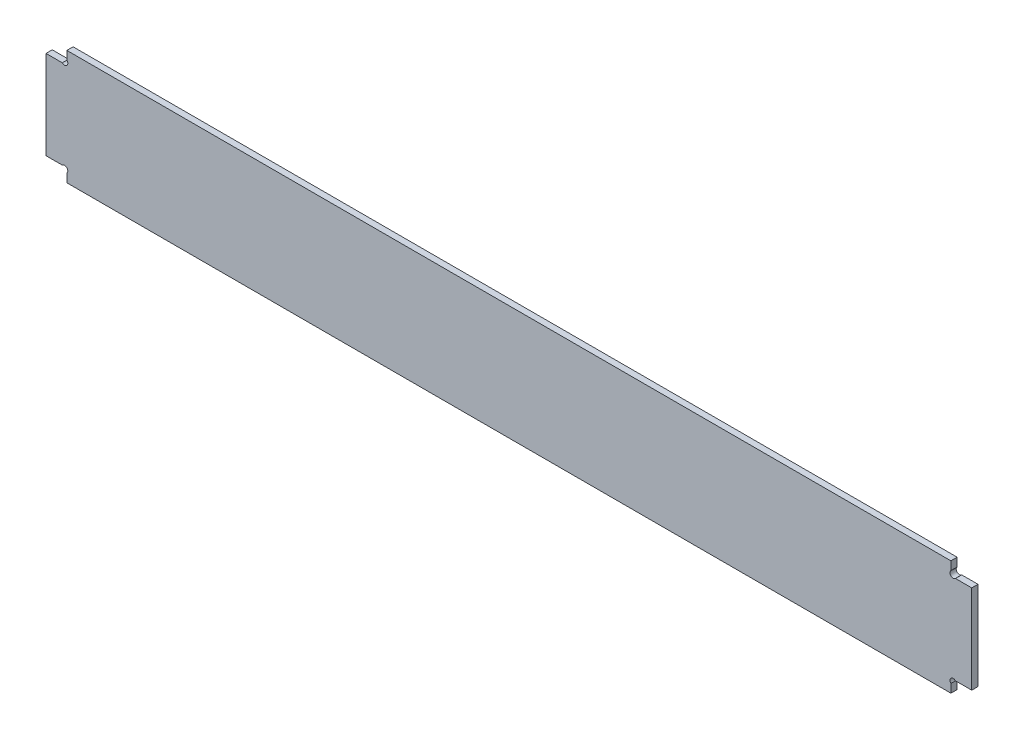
ISO-10303-21;
HEADER;
FILE_DESCRIPTION(('STEP AP214'),'2;1');
FILE_NAME('part.step','',(''),(''),'','','');
FILE_SCHEMA(('AUTOMOTIVE_DESIGN { 1 0 10303 214 1 1 1 1 }'));
ENDSEC;
DATA;
#1=APPLICATION_CONTEXT('core data for automotive mechanical design processes');
#2=APPLICATION_PROTOCOL_DEFINITION('international standard','automotive_design',2000,#1);
#3=PRODUCT_CONTEXT('',#1,'mechanical');
#4=PRODUCT('Part','Part','',(#3));
#5=PRODUCT_RELATED_PRODUCT_CATEGORY('part','',(#4));
#6=PRODUCT_DEFINITION_FORMATION('','',#4);
#7=PRODUCT_DEFINITION_CONTEXT('part definition',#1,'design');
#8=PRODUCT_DEFINITION('design','',#6,#7);
#9=PRODUCT_DEFINITION_SHAPE('','',#8);
#10=(LENGTH_UNIT() NAMED_UNIT(*) SI_UNIT(.MILLI.,.METRE.));
#11=(NAMED_UNIT(*) PLANE_ANGLE_UNIT() SI_UNIT($,.RADIAN.));
#12=(NAMED_UNIT(*) SI_UNIT($,.STERADIAN.) SOLID_ANGLE_UNIT());
#13=UNCERTAINTY_MEASURE_WITH_UNIT(LENGTH_MEASURE(1.E-05),#10,'distance_accuracy_value','');
#14=(GEOMETRIC_REPRESENTATION_CONTEXT(3) GLOBAL_UNCERTAINTY_ASSIGNED_CONTEXT((#13)) GLOBAL_UNIT_ASSIGNED_CONTEXT((#10,
#11,#12)) REPRESENTATION_CONTEXT('',''));
#15=CARTESIAN_POINT('',(0.,0.,0.));
#16=DIRECTION('',(0.,0.,1.));
#17=DIRECTION('',(1.,0.,0.));
#18=AXIS2_PLACEMENT_3D('',#15,#16,#17);
#19=CARTESIAN_POINT('',(8.90398448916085,5.15398448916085,3.));
#20=DIRECTION('',(0.,0.,-1.));
#21=DIRECTION('',(-1.,0.,0.));
#22=AXIS2_PLACEMENT_3D('',#19,#20,#21);
#23=CYLINDRICAL_SURFACE('',#22,1.55);
#24=CARTESIAN_POINT('',(8.90398448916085,5.15398448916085,0.));
#25=DIRECTION('',(0.,0.,-1.));
#26=DIRECTION('',(1.,0.,0.));
#27=AXIS2_PLACEMENT_3D('',#24,#25,#26);
#28=CIRCLE('',#27,1.55);
#29=CARTESIAN_POINT('',(7.8079689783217,6.25,0.));
#30=VERTEX_POINT('',#29);
#31=CARTESIAN_POINT('',(10.,4.0579689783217,0.));
#32=VERTEX_POINT('',#31);
#33=EDGE_CURVE('E142',#30,#32,#28,.T.);
#34=ORIENTED_EDGE('',*,*,#33,.T.);
#35=DIRECTION('',(0.,0.,-1.));
#36=VECTOR('',#35,1.);
#37=CARTESIAN_POINT('',(10.,4.0579689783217,3.));
#38=LINE('',#37,#36);
#39=CARTESIAN_POINT('',(10.,4.0579689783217,3.));
#40=VERTEX_POINT('',#39);
#41=EDGE_CURVE('E11',#40,#32,#38,.T.);
#42=ORIENTED_EDGE('',*,*,#41,.F.);
#43=CARTESIAN_POINT('',(8.90398448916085,5.15398448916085,3.));
#44=DIRECTION('',(0.,0.,-1.));
#45=DIRECTION('',(1.,0.,0.));
#46=AXIS2_PLACEMENT_3D('',#43,#44,#45);
#47=CIRCLE('',#46,1.55);
#48=CARTESIAN_POINT('',(7.8079689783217,6.25,3.));
#49=VERTEX_POINT('',#48);
#50=EDGE_CURVE('E185',#49,#40,#47,.T.);
#51=ORIENTED_EDGE('',*,*,#50,.F.);
#52=DIRECTION('',(0.,0.,-1.));
#53=VECTOR('',#52,1.);
#54=CARTESIAN_POINT('',(7.8079689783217,6.25,3.));
#55=LINE('',#54,#53);
#56=EDGE_CURVE('E155',#49,#30,#55,.T.);
#57=ORIENTED_EDGE('',*,*,#56,.T.);
#58=EDGE_LOOP('',(#34,#42,#51,#57));
#59=FACE_BOUND('',#58,.T.);
#60=ADVANCED_FACE('F26',(#59),#23,.F.);
#61=CARTESIAN_POINT('',(10.,4.0579689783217,3.));
#62=DIRECTION('',(1.,0.,0.));
#63=DIRECTION('',(0.,1.,0.));
#64=AXIS2_PLACEMENT_3D('',#61,#62,#63);
#65=PLANE('',#64);
#66=DIRECTION('',(0.,-1.,0.));
#67=VECTOR('',#66,1.);
#68=CARTESIAN_POINT('',(10.,4.0579689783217,0.));
#69=LINE('',#68,#67);
#70=CARTESIAN_POINT('',(10.,0.,0.));
#71=VERTEX_POINT('',#70);
#72=EDGE_CURVE('E138',#32,#71,#69,.T.);
#73=ORIENTED_EDGE('',*,*,#72,.T.);
#74=DIRECTION('',(0.,0.,-1.));
#75=VECTOR('',#74,1.);
#76=CARTESIAN_POINT('',(10.,0.,3.));
#77=LINE('',#76,#75);
#78=CARTESIAN_POINT('',(10.,0.,3.));
#79=VERTEX_POINT('',#78);
#80=EDGE_CURVE('E33',#79,#71,#77,.T.);
#81=ORIENTED_EDGE('',*,*,#80,.F.);
#82=DIRECTION('',(0.,-1.,0.));
#83=VECTOR('',#82,1.);
#84=CARTESIAN_POINT('',(10.,4.0579689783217,3.));
#85=LINE('',#84,#83);
#86=EDGE_CURVE('E151',#40,#79,#85,.T.);
#87=ORIENTED_EDGE('',*,*,#86,.F.);
#88=ORIENTED_EDGE('',*,*,#41,.T.);
#89=EDGE_LOOP('',(#73,#81,#87,#88));
#90=FACE_BOUND('',#89,.T.);
#91=ADVANCED_FACE('F150',(#90),#65,.F.);
#92=CARTESIAN_POINT('',(434.,0.,3.));
#93=DIRECTION('',(0.,1.,0.));
#94=DIRECTION('',(0.,0.,1.));
#95=AXIS2_PLACEMENT_3D('',#92,#93,#94);
#96=PLANE('',#95);
#97=DIRECTION('',(1.,0.,0.));
#98=VECTOR('',#97,1.);
#99=CARTESIAN_POINT('',(434.,0.,0.));
#100=LINE('',#99,#98);
#101=CARTESIAN_POINT('',(434.,0.,0.));
#102=VERTEX_POINT('',#101);
#103=EDGE_CURVE('E144',#71,#102,#100,.T.);
#104=ORIENTED_EDGE('',*,*,#103,.T.);
#105=DIRECTION('',(0.,0.,-1.));
#106=VECTOR('',#105,1.);
#107=CARTESIAN_POINT('',(434.,0.,3.));
#108=LINE('',#107,#106);
#109=CARTESIAN_POINT('',(434.,0.,3.));
#110=VERTEX_POINT('',#109);
#111=EDGE_CURVE('E251',#110,#102,#108,.T.);
#112=ORIENTED_EDGE('',*,*,#111,.F.);
#113=DIRECTION('',(1.,0.,0.));
#114=VECTOR('',#113,1.);
#115=CARTESIAN_POINT('',(434.,0.,3.));
#116=LINE('',#115,#114);
#117=EDGE_CURVE('E188',#79,#110,#116,.T.);
#118=ORIENTED_EDGE('',*,*,#117,.F.);
#119=ORIENTED_EDGE('',*,*,#80,.T.);
#120=EDGE_LOOP('',(#104,#112,#118,#119));
#121=FACE_BOUND('',#120,.T.);
#122=ADVANCED_FACE('F255',(#121),#96,.F.);
#123=CARTESIAN_POINT('',(434.,4.0579689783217,3.));
#124=DIRECTION('',(-1.,0.,0.));
#125=DIRECTION('',(0.,0.,1.));
#126=AXIS2_PLACEMENT_3D('',#123,#124,#125);
#127=PLANE('',#126);
#128=DIRECTION('',(0.,1.,0.));
#129=VECTOR('',#128,1.);
#130=CARTESIAN_POINT('',(434.,4.0579689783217,0.));
#131=LINE('',#130,#129);
#132=CARTESIAN_POINT('',(434.,4.0579689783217,0.));
#133=VERTEX_POINT('',#132);
#134=EDGE_CURVE('E159',#102,#133,#131,.T.);
#135=ORIENTED_EDGE('',*,*,#134,.T.);
#136=DIRECTION('',(0.,0.,-1.));
#137=VECTOR('',#136,1.);
#138=CARTESIAN_POINT('',(434.,4.0579689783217,3.));
#139=LINE('',#138,#137);
#140=CARTESIAN_POINT('',(434.,4.0579689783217,3.));
#141=VERTEX_POINT('',#140);
#142=EDGE_CURVE('E248',#141,#133,#139,.T.);
#143=ORIENTED_EDGE('',*,*,#142,.F.);
#144=DIRECTION('',(0.,1.,0.));
#145=VECTOR('',#144,1.);
#146=CARTESIAN_POINT('',(434.,4.0579689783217,3.));
#147=LINE('',#146,#145);
#148=EDGE_CURVE('E190',#110,#141,#147,.T.);
#149=ORIENTED_EDGE('',*,*,#148,.F.);
#150=ORIENTED_EDGE('',*,*,#111,.T.);
#151=EDGE_LOOP('',(#135,#143,#149,#150));
#152=FACE_BOUND('',#151,.T.);
#153=ADVANCED_FACE('F263',(#152),#127,.F.);
#154=CARTESIAN_POINT('',(435.096015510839,5.15398448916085,3.));
#155=DIRECTION('',(0.,0.,-1.));
#156=DIRECTION('',(-1.,0.,0.));
#157=AXIS2_PLACEMENT_3D('',#154,#155,#156);
#158=CYLINDRICAL_SURFACE('',#157,1.55);
#159=CARTESIAN_POINT('',(435.096015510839,5.15398448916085,0.));
#160=DIRECTION('',(0.,0.,-1.));
#161=DIRECTION('',(-1.,0.,0.));
#162=AXIS2_PLACEMENT_3D('',#159,#160,#161);
#163=CIRCLE('',#162,1.55);
#164=CARTESIAN_POINT('',(436.192031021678,6.25,0.));
#165=VERTEX_POINT('',#164);
#166=EDGE_CURVE('E161',#133,#165,#163,.T.);
#167=ORIENTED_EDGE('',*,*,#166,.T.);
#168=DIRECTION('',(0.,0.,-1.));
#169=VECTOR('',#168,1.);
#170=CARTESIAN_POINT('',(436.192031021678,6.25,3.));
#171=LINE('',#170,#169);
#172=CARTESIAN_POINT('',(436.192031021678,6.25,3.));
#173=VERTEX_POINT('',#172);
#174=EDGE_CURVE('E245',#173,#165,#171,.T.);
#175=ORIENTED_EDGE('',*,*,#174,.F.);
#176=CARTESIAN_POINT('',(435.096015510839,5.15398448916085,3.));
#177=DIRECTION('',(0.,0.,-1.));
#178=DIRECTION('',(-1.,0.,0.));
#179=AXIS2_PLACEMENT_3D('',#176,#177,#178);
#180=CIRCLE('',#179,1.55);
#181=EDGE_CURVE('E192',#141,#173,#180,.T.);
#182=ORIENTED_EDGE('',*,*,#181,.F.);
#183=ORIENTED_EDGE('',*,*,#142,.T.);
#184=EDGE_LOOP('',(#167,#175,#182,#183));
#185=FACE_BOUND('',#184,.T.);
#186=ADVANCED_FACE('F266',(#185),#158,.F.);
#187=CARTESIAN_POINT('',(436.192031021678,6.25,3.));
#188=DIRECTION('',(0.,1.,0.));
#189=DIRECTION('',(-1.,0.,0.));
#190=AXIS2_PLACEMENT_3D('',#187,#188,#189);
#191=PLANE('',#190);
#192=DIRECTION('',(1.,0.,0.));
#193=VECTOR('',#192,1.);
#194=CARTESIAN_POINT('',(436.192031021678,6.25,0.));
#195=LINE('',#194,#193);
#196=CARTESIAN_POINT('',(444.,6.25,0.));
#197=VERTEX_POINT('',#196);
#198=EDGE_CURVE('E163',#165,#197,#195,.T.);
#199=ORIENTED_EDGE('',*,*,#198,.T.);
#200=DIRECTION('',(0.,0.,-1.));
#201=VECTOR('',#200,1.);
#202=CARTESIAN_POINT('',(444.,6.25,3.));
#203=LINE('',#202,#201);
#204=CARTESIAN_POINT('',(444.,6.25,3.));
#205=VERTEX_POINT('',#204);
#206=EDGE_CURVE('E242',#205,#197,#203,.T.);
#207=ORIENTED_EDGE('',*,*,#206,.F.);
#208=DIRECTION('',(1.,0.,0.));
#209=VECTOR('',#208,1.);
#210=CARTESIAN_POINT('',(436.192031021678,6.25,3.));
#211=LINE('',#210,#209);
#212=EDGE_CURVE('E194',#173,#205,#211,.T.);
#213=ORIENTED_EDGE('',*,*,#212,.F.);
#214=ORIENTED_EDGE('',*,*,#174,.T.);
#215=EDGE_LOOP('',(#199,#207,#213,#214));
#216=FACE_BOUND('',#215,.T.);
#217=ADVANCED_FACE('F271',(#216),#191,.F.);
#218=CARTESIAN_POINT('',(444.,48.75,3.));
#219=DIRECTION('',(-1.,0.,0.));
#220=DIRECTION('',(0.,0.,1.));
#221=AXIS2_PLACEMENT_3D('',#218,#219,#220);
#222=PLANE('',#221);
#223=DIRECTION('',(0.,1.,0.));
#224=VECTOR('',#223,1.);
#225=CARTESIAN_POINT('',(444.,48.75,0.));
#226=LINE('',#225,#224);
#227=CARTESIAN_POINT('',(444.,48.75,0.));
#228=VERTEX_POINT('',#227);
#229=EDGE_CURVE('E165',#197,#228,#226,.T.);
#230=ORIENTED_EDGE('',*,*,#229,.T.);
#231=DIRECTION('',(0.,0.,-1.));
#232=VECTOR('',#231,1.);
#233=CARTESIAN_POINT('',(444.,48.75,3.));
#234=LINE('',#233,#232);
#235=CARTESIAN_POINT('',(444.,48.75,3.));
#236=VERTEX_POINT('',#235);
#237=EDGE_CURVE('E239',#236,#228,#234,.T.);
#238=ORIENTED_EDGE('',*,*,#237,.F.);
#239=DIRECTION('',(0.,1.,0.));
#240=VECTOR('',#239,1.);
#241=CARTESIAN_POINT('',(444.,48.75,3.));
#242=LINE('',#241,#240);
#243=EDGE_CURVE('E196',#205,#236,#242,.T.);
#244=ORIENTED_EDGE('',*,*,#243,.F.);
#245=ORIENTED_EDGE('',*,*,#206,.T.);
#246=EDGE_LOOP('',(#230,#238,#244,#245));
#247=FACE_BOUND('',#246,.T.);
#248=ADVANCED_FACE('F277',(#247),#222,.F.);
#249=CARTESIAN_POINT('',(436.192031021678,48.75,3.));
#250=DIRECTION('',(0.,-1.,0.));
#251=DIRECTION('',(0.,0.,-1.));
#252=AXIS2_PLACEMENT_3D('',#249,#250,#251);
#253=PLANE('',#252);
#254=DIRECTION('',(-1.,0.,0.));
#255=VECTOR('',#254,1.);
#256=CARTESIAN_POINT('',(436.192031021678,48.75,0.));
#257=LINE('',#256,#255);
#258=CARTESIAN_POINT('',(436.192031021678,48.75,0.));
#259=VERTEX_POINT('',#258);
#260=EDGE_CURVE('E167',#228,#259,#257,.T.);
#261=ORIENTED_EDGE('',*,*,#260,.T.);
#262=DIRECTION('',(0.,0.,-1.));
#263=VECTOR('',#262,1.);
#264=CARTESIAN_POINT('',(436.192031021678,48.75,3.));
#265=LINE('',#264,#263);
#266=CARTESIAN_POINT('',(436.192031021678,48.75,3.));
#267=VERTEX_POINT('',#266);
#268=EDGE_CURVE('E236',#267,#259,#265,.T.);
#269=ORIENTED_EDGE('',*,*,#268,.F.);
#270=DIRECTION('',(-1.,0.,0.));
#271=VECTOR('',#270,1.);
#272=CARTESIAN_POINT('',(436.192031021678,48.75,3.));
#273=LINE('',#272,#271);
#274=EDGE_CURVE('E198',#236,#267,#273,.T.);
#275=ORIENTED_EDGE('',*,*,#274,.F.);
#276=ORIENTED_EDGE('',*,*,#237,.T.);
#277=EDGE_LOOP('',(#261,#269,#275,#276));
#278=FACE_BOUND('',#277,.T.);
#279=ADVANCED_FACE('F281',(#278),#253,.F.);
#280=CARTESIAN_POINT('',(435.096015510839,49.8460155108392,3.));
#281=DIRECTION('',(0.,0.,-1.));
#282=DIRECTION('',(-1.,0.,0.));
#283=AXIS2_PLACEMENT_3D('',#280,#281,#282);
#284=CYLINDRICAL_SURFACE('',#283,1.55);
#285=CARTESIAN_POINT('',(435.096015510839,49.8460155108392,0.));
#286=DIRECTION('',(0.,0.,-1.));
#287=DIRECTION('',(1.,0.,0.));
#288=AXIS2_PLACEMENT_3D('',#285,#286,#287);
#289=CIRCLE('',#288,1.55);
#290=CARTESIAN_POINT('',(434.,50.9420310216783,0.));
#291=VERTEX_POINT('',#290);
#292=EDGE_CURVE('E169',#259,#291,#289,.T.);
#293=ORIENTED_EDGE('',*,*,#292,.T.);
#294=DIRECTION('',(0.,0.,-1.));
#295=VECTOR('',#294,1.);
#296=CARTESIAN_POINT('',(434.,50.9420310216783,3.));
#297=LINE('',#296,#295);
#298=CARTESIAN_POINT('',(434.,50.9420310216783,3.));
#299=VERTEX_POINT('',#298);
#300=EDGE_CURVE('E233',#299,#291,#297,.T.);
#301=ORIENTED_EDGE('',*,*,#300,.F.);
#302=CARTESIAN_POINT('',(435.096015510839,49.8460155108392,3.));
#303=DIRECTION('',(0.,0.,-1.));
#304=DIRECTION('',(1.,0.,0.));
#305=AXIS2_PLACEMENT_3D('',#302,#303,#304);
#306=CIRCLE('',#305,1.55);
#307=EDGE_CURVE('E200',#267,#299,#306,.T.);
#308=ORIENTED_EDGE('',*,*,#307,.F.);
#309=ORIENTED_EDGE('',*,*,#268,.T.);
#310=EDGE_LOOP('',(#293,#301,#308,#309));
#311=FACE_BOUND('',#310,.T.);
#312=ADVANCED_FACE('F286',(#311),#284,.F.);
#313=CARTESIAN_POINT('',(434.,50.9420310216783,3.));
#314=DIRECTION('',(-1.,0.,0.));
#315=DIRECTION('',(0.,0.,1.));
#316=AXIS2_PLACEMENT_3D('',#313,#314,#315);
#317=PLANE('',#316);
#318=DIRECTION('',(0.,1.,0.));
#319=VECTOR('',#318,1.);
#320=CARTESIAN_POINT('',(434.,50.9420310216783,0.));
#321=LINE('',#320,#319);
#322=CARTESIAN_POINT('',(434.,55.,0.));
#323=VERTEX_POINT('',#322);
#324=EDGE_CURVE('E171',#291,#323,#321,.T.);
#325=ORIENTED_EDGE('',*,*,#324,.T.);
#326=DIRECTION('',(0.,0.,-1.));
#327=VECTOR('',#326,1.);
#328=CARTESIAN_POINT('',(434.,55.,3.));
#329=LINE('',#328,#327);
#330=CARTESIAN_POINT('',(434.,55.,3.));
#331=VERTEX_POINT('',#330);
#332=EDGE_CURVE('E230',#331,#323,#329,.T.);
#333=ORIENTED_EDGE('',*,*,#332,.F.);
#334=DIRECTION('',(0.,1.,0.));
#335=VECTOR('',#334,1.);
#336=CARTESIAN_POINT('',(434.,50.9420310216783,3.));
#337=LINE('',#336,#335);
#338=EDGE_CURVE('E202',#299,#331,#337,.T.);
#339=ORIENTED_EDGE('',*,*,#338,.F.);
#340=ORIENTED_EDGE('',*,*,#300,.T.);
#341=EDGE_LOOP('',(#325,#333,#339,#340));
#342=FACE_BOUND('',#341,.T.);
#343=ADVANCED_FACE('F292',(#342),#317,.F.);
#344=CARTESIAN_POINT('',(10.,55.,3.));
#345=DIRECTION('',(0.,-1.,0.));
#346=DIRECTION('',(0.,0.,-1.));
#347=AXIS2_PLACEMENT_3D('',#344,#345,#346);
#348=PLANE('',#347);
#349=DIRECTION('',(-1.,0.,0.));
#350=VECTOR('',#349,1.);
#351=CARTESIAN_POINT('',(10.,55.,0.));
#352=LINE('',#351,#350);
#353=CARTESIAN_POINT('',(10.,55.,0.));
#354=VERTEX_POINT('',#353);
#355=EDGE_CURVE('E173',#323,#354,#352,.T.);
#356=ORIENTED_EDGE('',*,*,#355,.T.);
#357=DIRECTION('',(0.,0.,-1.));
#358=VECTOR('',#357,1.);
#359=CARTESIAN_POINT('',(10.,55.,3.));
#360=LINE('',#359,#358);
#361=CARTESIAN_POINT('',(10.,55.,3.));
#362=VERTEX_POINT('',#361);
#363=EDGE_CURVE('E227',#362,#354,#360,.T.);
#364=ORIENTED_EDGE('',*,*,#363,.F.);
#365=DIRECTION('',(-1.,0.,0.));
#366=VECTOR('',#365,1.);
#367=CARTESIAN_POINT('',(10.,55.,3.));
#368=LINE('',#367,#366);
#369=EDGE_CURVE('E204',#331,#362,#368,.T.);
#370=ORIENTED_EDGE('',*,*,#369,.F.);
#371=ORIENTED_EDGE('',*,*,#332,.T.);
#372=EDGE_LOOP('',(#356,#364,#370,#371));
#373=FACE_BOUND('',#372,.T.);
#374=ADVANCED_FACE('F296',(#373),#348,.F.);
#375=CARTESIAN_POINT('',(10.,50.9420310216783,3.));
#376=DIRECTION('',(1.,0.,0.));
#377=DIRECTION('',(0.,0.,-1.));
#378=AXIS2_PLACEMENT_3D('',#375,#376,#377);
#379=PLANE('',#378);
#380=DIRECTION('',(0.,-1.,0.));
#381=VECTOR('',#380,1.);
#382=CARTESIAN_POINT('',(10.,50.9420310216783,0.));
#383=LINE('',#382,#381);
#384=CARTESIAN_POINT('',(10.,50.9420310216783,0.));
#385=VERTEX_POINT('',#384);
#386=EDGE_CURVE('E175',#354,#385,#383,.T.);
#387=ORIENTED_EDGE('',*,*,#386,.T.);
#388=DIRECTION('',(0.,0.,-1.));
#389=VECTOR('',#388,1.);
#390=CARTESIAN_POINT('',(10.,50.9420310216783,3.));
#391=LINE('',#390,#389);
#392=CARTESIAN_POINT('',(10.,50.9420310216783,3.));
#393=VERTEX_POINT('',#392);
#394=EDGE_CURVE('E224',#393,#385,#391,.T.);
#395=ORIENTED_EDGE('',*,*,#394,.F.);
#396=DIRECTION('',(0.,-1.,0.));
#397=VECTOR('',#396,1.);
#398=CARTESIAN_POINT('',(10.,50.9420310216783,3.));
#399=LINE('',#398,#397);
#400=EDGE_CURVE('E206',#362,#393,#399,.T.);
#401=ORIENTED_EDGE('',*,*,#400,.F.);
#402=ORIENTED_EDGE('',*,*,#363,.T.);
#403=EDGE_LOOP('',(#387,#395,#401,#402));
#404=FACE_BOUND('',#403,.T.);
#405=ADVANCED_FACE('F301',(#404),#379,.F.);
#406=CARTESIAN_POINT('',(8.90398448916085,49.8460155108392,3.));
#407=DIRECTION('',(0.,0.,-1.));
#408=DIRECTION('',(-1.,0.,0.));
#409=AXIS2_PLACEMENT_3D('',#406,#407,#408);
#410=CYLINDRICAL_SURFACE('',#409,1.55);
#411=CARTESIAN_POINT('',(8.90398448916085,49.8460155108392,0.));
#412=DIRECTION('',(0.,0.,-1.));
#413=DIRECTION('',(-1.,0.,0.));
#414=AXIS2_PLACEMENT_3D('',#411,#412,#413);
#415=CIRCLE('',#414,1.55);
#416=CARTESIAN_POINT('',(7.80796897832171,48.75,0.));
#417=VERTEX_POINT('',#416);
#418=EDGE_CURVE('E177',#385,#417,#415,.T.);
#419=ORIENTED_EDGE('',*,*,#418,.T.);
#420=DIRECTION('',(0.,0.,-1.));
#421=VECTOR('',#420,1.);
#422=CARTESIAN_POINT('',(7.80796897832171,48.75,3.));
#423=LINE('',#422,#421);
#424=CARTESIAN_POINT('',(7.80796897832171,48.75,3.));
#425=VERTEX_POINT('',#424);
#426=EDGE_CURVE('E221',#425,#417,#423,.T.);
#427=ORIENTED_EDGE('',*,*,#426,.F.);
#428=CARTESIAN_POINT('',(8.90398448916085,49.8460155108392,3.));
#429=DIRECTION('',(0.,0.,-1.));
#430=DIRECTION('',(-1.,0.,0.));
#431=AXIS2_PLACEMENT_3D('',#428,#429,#430);
#432=CIRCLE('',#431,1.55);
#433=EDGE_CURVE('E208',#393,#425,#432,.T.);
#434=ORIENTED_EDGE('',*,*,#433,.F.);
#435=ORIENTED_EDGE('',*,*,#394,.T.);
#436=EDGE_LOOP('',(#419,#427,#434,#435));
#437=FACE_BOUND('',#436,.T.);
#438=ADVANCED_FACE('F307',(#437),#410,.F.);
#439=CARTESIAN_POINT('',(7.80796897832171,48.75,3.));
#440=DIRECTION('',(0.,-1.,0.));
#441=DIRECTION('',(0.,0.,-1.));
#442=AXIS2_PLACEMENT_3D('',#439,#440,#441);
#443=PLANE('',#442);
#444=DIRECTION('',(-1.,0.,0.));
#445=VECTOR('',#444,1.);
#446=CARTESIAN_POINT('',(7.80796897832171,48.75,0.));
#447=LINE('',#446,#445);
#448=CARTESIAN_POINT('',(0.,48.75,0.));
#449=VERTEX_POINT('',#448);
#450=EDGE_CURVE('E179',#417,#449,#447,.T.);
#451=ORIENTED_EDGE('',*,*,#450,.T.);
#452=DIRECTION('',(0.,0.,-1.));
#453=VECTOR('',#452,1.);
#454=CARTESIAN_POINT('',(0.,48.75,3.));
#455=LINE('',#454,#453);
#456=CARTESIAN_POINT('',(0.,48.75,3.));
#457=VERTEX_POINT('',#456);
#458=EDGE_CURVE('E218',#457,#449,#455,.T.);
#459=ORIENTED_EDGE('',*,*,#458,.F.);
#460=DIRECTION('',(-1.,0.,0.));
#461=VECTOR('',#460,1.);
#462=CARTESIAN_POINT('',(7.80796897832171,48.75,3.));
#463=LINE('',#462,#461);
#464=EDGE_CURVE('E210',#425,#457,#463,.T.);
#465=ORIENTED_EDGE('',*,*,#464,.F.);
#466=ORIENTED_EDGE('',*,*,#426,.T.);
#467=EDGE_LOOP('',(#451,#459,#465,#466));
#468=FACE_BOUND('',#467,.T.);
#469=ADVANCED_FACE('F311',(#468),#443,.F.);
#470=CARTESIAN_POINT('',(0.,48.75,3.));
#471=DIRECTION('',(1.,0.,0.));
#472=DIRECTION('',(0.,0.,-1.));
#473=AXIS2_PLACEMENT_3D('',#470,#471,#472);
#474=PLANE('',#473);
#475=DIRECTION('',(0.,-1.,0.));
#476=VECTOR('',#475,1.);
#477=CARTESIAN_POINT('',(0.,48.75,0.));
#478=LINE('',#477,#476);
#479=CARTESIAN_POINT('',(0.,6.25,0.));
#480=VERTEX_POINT('',#479);
#481=EDGE_CURVE('E181',#449,#480,#478,.T.);
#482=ORIENTED_EDGE('',*,*,#481,.T.);
#483=DIRECTION('',(0.,0.,-1.));
#484=VECTOR('',#483,1.);
#485=CARTESIAN_POINT('',(0.,6.25,3.));
#486=LINE('',#485,#484);
#487=CARTESIAN_POINT('',(0.,6.25,3.));
#488=VERTEX_POINT('',#487);
#489=EDGE_CURVE('E215',#488,#480,#486,.T.);
#490=ORIENTED_EDGE('',*,*,#489,.F.);
#491=DIRECTION('',(0.,-1.,0.));
#492=VECTOR('',#491,1.);
#493=CARTESIAN_POINT('',(0.,48.75,3.));
#494=LINE('',#493,#492);
#495=EDGE_CURVE('E45',#457,#488,#494,.T.);
#496=ORIENTED_EDGE('',*,*,#495,.F.);
#497=ORIENTED_EDGE('',*,*,#458,.T.);
#498=EDGE_LOOP('',(#482,#490,#496,#497));
#499=FACE_BOUND('',#498,.T.);
#500=ADVANCED_FACE('F314',(#499),#474,.F.);
#501=CARTESIAN_POINT('',(7.8079689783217,6.25,3.));
#502=DIRECTION('',(0.,1.,0.));
#503=DIRECTION('',(-1.,0.,0.));
#504=AXIS2_PLACEMENT_3D('',#501,#502,#503);
#505=PLANE('',#504);
#506=DIRECTION('',(1.,0.,0.));
#507=VECTOR('',#506,1.);
#508=CARTESIAN_POINT('',(7.8079689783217,6.25,0.));
#509=LINE('',#508,#507);
#510=EDGE_CURVE('E183',#480,#30,#509,.T.);
#511=ORIENTED_EDGE('',*,*,#510,.T.);
#512=ORIENTED_EDGE('',*,*,#56,.F.);
#513=DIRECTION('',(1.,0.,0.));
#514=VECTOR('',#513,1.);
#515=CARTESIAN_POINT('',(7.8079689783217,6.25,3.));
#516=LINE('',#515,#514);
#517=EDGE_CURVE('E40',#488,#49,#516,.T.);
#518=ORIENTED_EDGE('',*,*,#517,.F.);
#519=ORIENTED_EDGE('',*,*,#489,.T.);
#520=EDGE_LOOP('',(#511,#512,#518,#519));
#521=FACE_BOUND('',#520,.T.);
#522=ADVANCED_FACE('F316',(#521),#505,.F.);
#523=CARTESIAN_POINT('',(8.90398448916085,5.15398448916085,3.));
#524=DIRECTION('',(0.,0.,1.));
#525=DIRECTION('',(1.,0.,0.));
#526=AXIS2_PLACEMENT_3D('',#523,#524,#525);
#527=PLANE('',#526);
#528=ORIENTED_EDGE('',*,*,#50,.T.);
#529=ORIENTED_EDGE('',*,*,#86,.T.);
#530=ORIENTED_EDGE('',*,*,#117,.T.);
#531=ORIENTED_EDGE('',*,*,#148,.T.);
#532=ORIENTED_EDGE('',*,*,#181,.T.);
#533=ORIENTED_EDGE('',*,*,#212,.T.);
#534=ORIENTED_EDGE('',*,*,#243,.T.);
#535=ORIENTED_EDGE('',*,*,#274,.T.);
#536=ORIENTED_EDGE('',*,*,#307,.T.);
#537=ORIENTED_EDGE('',*,*,#338,.T.);
#538=ORIENTED_EDGE('',*,*,#369,.T.);
#539=ORIENTED_EDGE('',*,*,#400,.T.);
#540=ORIENTED_EDGE('',*,*,#433,.T.);
#541=ORIENTED_EDGE('',*,*,#464,.T.);
#542=ORIENTED_EDGE('',*,*,#495,.T.);
#543=ORIENTED_EDGE('',*,*,#517,.T.);
#544=EDGE_LOOP('',(#528,#529,#530,#531,#532,#533,#534,#535,#536,#537,#538,#539,#540,#541,#542,#543));
#545=FACE_BOUND('',#544,.T.);
#546=ADVANCED_FACE('F258',(#545),#527,.T.);
#547=CARTESIAN_POINT('',(8.90398448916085,5.15398448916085,0.));
#548=DIRECTION('',(0.,0.,1.));
#549=DIRECTION('',(1.,0.,0.));
#550=AXIS2_PLACEMENT_3D('',#547,#548,#549);
#551=PLANE('',#550);
#552=ORIENTED_EDGE('',*,*,#33,.F.);
#553=ORIENTED_EDGE('',*,*,#510,.F.);
#554=ORIENTED_EDGE('',*,*,#481,.F.);
#555=ORIENTED_EDGE('',*,*,#450,.F.);
#556=ORIENTED_EDGE('',*,*,#418,.F.);
#557=ORIENTED_EDGE('',*,*,#386,.F.);
#558=ORIENTED_EDGE('',*,*,#355,.F.);
#559=ORIENTED_EDGE('',*,*,#324,.F.);
#560=ORIENTED_EDGE('',*,*,#292,.F.);
#561=ORIENTED_EDGE('',*,*,#260,.F.);
#562=ORIENTED_EDGE('',*,*,#229,.F.);
#563=ORIENTED_EDGE('',*,*,#198,.F.);
#564=ORIENTED_EDGE('',*,*,#166,.F.);
#565=ORIENTED_EDGE('',*,*,#134,.F.);
#566=ORIENTED_EDGE('',*,*,#103,.F.);
#567=ORIENTED_EDGE('',*,*,#72,.F.);
#568=EDGE_LOOP('',(#552,#553,#554,#555,#556,#557,#558,#559,#560,#561,#562,#563,#564,#565,#566,#567));
#569=FACE_BOUND('',#568,.T.);
#570=ADVANCED_FACE('F139',(#569),#551,.F.);
#571=CLOSED_SHELL('',(#60,#91,#122,#153,#186,#217,#248,#279,#312,#343,#374,#405,#438,#469,#500,
#522,#546,#570));
#572=MANIFOLD_SOLID_BREP('B2',#571);
#573=ADVANCED_BREP_SHAPE_REPRESENTATION('',(#18,#572),#14);
#574=SHAPE_DEFINITION_REPRESENTATION(#9,#573);
ENDSEC;
END-ISO-10303-21;
